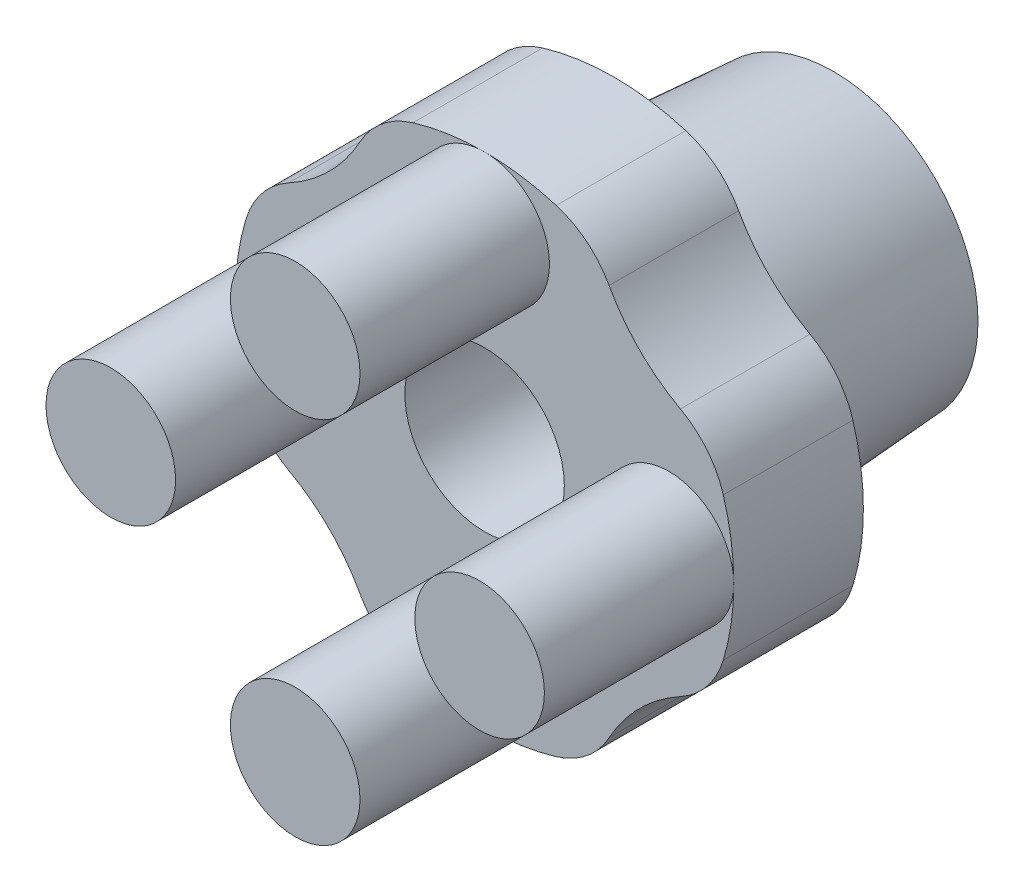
ISO-10303-21;
HEADER;
FILE_DESCRIPTION(('STEP AP214'),'2;1');
FILE_NAME('part.step','',(''),(''),'','','');
FILE_SCHEMA(('AUTOMOTIVE_DESIGN { 1 0 10303 214 1 1 1 1 }'));
ENDSEC;
DATA;
#1=APPLICATION_CONTEXT('core data for automotive mechanical design processes');
#2=APPLICATION_PROTOCOL_DEFINITION('international standard','automotive_design',2000,#1);
#3=PRODUCT_CONTEXT('',#1,'mechanical');
#4=PRODUCT('Part','Part','',(#3));
#5=PRODUCT_RELATED_PRODUCT_CATEGORY('part','',(#4));
#6=PRODUCT_DEFINITION_FORMATION('','',#4);
#7=PRODUCT_DEFINITION_CONTEXT('part definition',#1,'design');
#8=PRODUCT_DEFINITION('design','',#6,#7);
#9=PRODUCT_DEFINITION_SHAPE('','',#8);
#10=(LENGTH_UNIT() NAMED_UNIT(*) SI_UNIT(.MILLI.,.METRE.));
#11=(NAMED_UNIT(*) PLANE_ANGLE_UNIT() SI_UNIT($,.RADIAN.));
#12=(NAMED_UNIT(*) SI_UNIT($,.STERADIAN.) SOLID_ANGLE_UNIT());
#13=UNCERTAINTY_MEASURE_WITH_UNIT(LENGTH_MEASURE(1.E-05),#10,'distance_accuracy_value','');
#14=(GEOMETRIC_REPRESENTATION_CONTEXT(3) GLOBAL_UNCERTAINTY_ASSIGNED_CONTEXT((#13)) GLOBAL_UNIT_ASSIGNED_CONTEXT((#10,
#11,#12)) REPRESENTATION_CONTEXT('',''));
#15=CARTESIAN_POINT('',(0.,0.,0.));
#16=DIRECTION('',(0.,0.,1.));
#17=DIRECTION('',(1.,0.,0.));
#18=AXIS2_PLACEMENT_3D('',#15,#16,#17);
#19=CARTESIAN_POINT('',(-25.,0.,35.));
#20=DIRECTION('',(0.,0.,-1.));
#21=DIRECTION('',(-1.,0.,0.));
#22=AXIS2_PLACEMENT_3D('',#19,#20,#21);
#23=PLANE('',#22);
#24=CARTESIAN_POINT('',(0.,0.,35.));
#25=DIRECTION('',(0.,0.,1.));
#26=DIRECTION('',(1.,0.,0.));
#27=AXIS2_PLACEMENT_3D('',#24,#25,#26);
#28=CIRCLE('',#27,8.);
#29=CARTESIAN_POINT('',(8.,0.,35.));
#30=VERTEX_POINT('',#29);
#31=EDGE_CURVE('E269',#30,#30,#28,.T.);
#32=ORIENTED_EDGE('',*,*,#31,.F.);
#33=EDGE_LOOP('',(#32));
#34=FACE_BOUND('',#33,.T.);
#35=CARTESIAN_POINT('',(28.2842712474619,-28.2842712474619,35.));
#36=DIRECTION('',(0.,0.,1.));
#37=DIRECTION('',(1.,0.,0.));
#38=AXIS2_PLACEMENT_3D('',#35,#36,#37);
#39=CIRCLE('',#38,18.);
#40=CARTESIAN_POINT('',(19.644919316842,-12.4930838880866,35.));
#41=VERTEX_POINT('',#40);
#42=CARTESIAN_POINT('',(12.4930838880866,-19.644919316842,35.));
#43=VERTEX_POINT('',#42);
#44=EDGE_CURVE('E296',#41,#43,#39,.T.);
#45=ORIENTED_EDGE('',*,*,#44,.F.);
#46=CARTESIAN_POINT('',(15.325243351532,-4.59749020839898,35.));
#47=DIRECTION('',(0.,0.,-1.));
#48=DIRECTION('',(-1.,0.,0.));
#49=AXIS2_PLACEMENT_3D('',#46,#47,#48);
#50=CIRCLE('',#49,9.);
#51=CARTESIAN_POINT('',(23.9456927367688,-7.18357845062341,35.));
#52=VERTEX_POINT('',#51);
#53=EDGE_CURVE('E147',#41,#52,#50,.F.);
#54=ORIENTED_EDGE('',*,*,#53,.T.);
#55=CARTESIAN_POINT('',(0.,0.,35.));
#56=DIRECTION('',(0.,0.,1.));
#57=DIRECTION('',(1.,0.,0.));
#58=AXIS2_PLACEMENT_3D('',#55,#56,#57);
#59=CIRCLE('',#58,25.);
#60=CARTESIAN_POINT('',(25.,0.,35.));
#61=VERTEX_POINT('',#60);
#62=EDGE_CURVE('E141',#52,#61,#59,.T.);
#63=ORIENTED_EDGE('',*,*,#62,.T.);
#64=CARTESIAN_POINT('',(18.5,0.,35.));
#65=DIRECTION('',(0.,0.,1.));
#66=DIRECTION('',(1.,0.,0.));
#67=AXIS2_PLACEMENT_3D('',#64,#65,#66);
#68=CIRCLE('',#67,6.5);
#69=EDGE_CURVE('E146',#61,#61,#68,.T.);
#70=ORIENTED_EDGE('',*,*,#69,.F.);
#71=CARTESIAN_POINT('',(23.9456927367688,7.18357845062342,35.));
#72=VERTEX_POINT('',#71);
#73=EDGE_CURVE('E151',#61,#72,#59,.T.);
#74=ORIENTED_EDGE('',*,*,#73,.T.);
#75=CARTESIAN_POINT('',(15.325243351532,4.59749020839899,35.));
#76=DIRECTION('',(0.,0.,-1.));
#77=DIRECTION('',(-1.,0.,0.));
#78=AXIS2_PLACEMENT_3D('',#75,#76,#77);
#79=CIRCLE('',#78,9.);
#80=CARTESIAN_POINT('',(19.644919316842,12.4930838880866,35.));
#81=VERTEX_POINT('',#80);
#82=EDGE_CURVE('E265',#72,#81,#79,.F.);
#83=ORIENTED_EDGE('',*,*,#82,.T.);
#84=CARTESIAN_POINT('',(28.2842712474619,28.2842712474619,35.));
#85=DIRECTION('',(0.,0.,1.));
#86=DIRECTION('',(1.,0.,0.));
#87=AXIS2_PLACEMENT_3D('',#84,#85,#86);
#88=CIRCLE('',#87,18.);
#89=CARTESIAN_POINT('',(12.4930838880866,19.644919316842,35.));
#90=VERTEX_POINT('',#89);
#91=EDGE_CURVE('E225',#90,#81,#88,.T.);
#92=ORIENTED_EDGE('',*,*,#91,.F.);
#93=CARTESIAN_POINT('',(4.59749020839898,15.325243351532,35.));
#94=DIRECTION('',(0.,0.,-1.));
#95=DIRECTION('',(-1.,0.,0.));
#96=AXIS2_PLACEMENT_3D('',#93,#94,#95);
#97=CIRCLE('',#96,9.);
#98=CARTESIAN_POINT('',(7.18357845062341,23.9456927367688,35.));
#99=VERTEX_POINT('',#98);
#100=EDGE_CURVE('E267',#90,#99,#97,.F.);
#101=ORIENTED_EDGE('',*,*,#100,.T.);
#102=CARTESIAN_POINT('',(0.,25.,35.));
#103=VERTEX_POINT('',#102);
#104=EDGE_CURVE('E153',#99,#103,#59,.T.);
#105=ORIENTED_EDGE('',*,*,#104,.T.);
#106=CARTESIAN_POINT('',(0.,18.5,35.));
#107=DIRECTION('',(0.,0.,1.));
#108=DIRECTION('',(1.,0.,0.));
#109=AXIS2_PLACEMENT_3D('',#106,#107,#108);
#110=CIRCLE('',#109,6.5);
#111=EDGE_CURVE('E312',#103,#103,#110,.T.);
#112=ORIENTED_EDGE('',*,*,#111,.F.);
#113=CARTESIAN_POINT('',(-7.18357845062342,23.9456927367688,35.));
#114=VERTEX_POINT('',#113);
#115=EDGE_CURVE('E160',#103,#114,#59,.T.);
#116=ORIENTED_EDGE('',*,*,#115,.T.);
#117=CARTESIAN_POINT('',(-4.59749020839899,15.325243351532,35.));
#118=DIRECTION('',(0.,0.,-1.));
#119=DIRECTION('',(-1.,0.,0.));
#120=AXIS2_PLACEMENT_3D('',#117,#118,#119);
#121=CIRCLE('',#120,9.);
#122=CARTESIAN_POINT('',(-12.4930838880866,19.644919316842,35.));
#123=VERTEX_POINT('',#122);
#124=EDGE_CURVE('E274',#114,#123,#121,.F.);
#125=ORIENTED_EDGE('',*,*,#124,.T.);
#126=CARTESIAN_POINT('',(-28.2842712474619,28.2842712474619,35.));
#127=DIRECTION('',(0.,0.,1.));
#128=DIRECTION('',(1.,0.,0.));
#129=AXIS2_PLACEMENT_3D('',#126,#127,#128);
#130=CIRCLE('',#129,18.);
#131=CARTESIAN_POINT('',(-19.644919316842,12.4930838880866,35.));
#132=VERTEX_POINT('',#131);
#133=EDGE_CURVE('E290',#132,#123,#130,.T.);
#134=ORIENTED_EDGE('',*,*,#133,.F.);
#135=CARTESIAN_POINT('',(-15.325243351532,4.59749020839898,35.));
#136=DIRECTION('',(0.,0.,-1.));
#137=DIRECTION('',(-1.,0.,0.));
#138=AXIS2_PLACEMENT_3D('',#135,#136,#137);
#139=CIRCLE('',#138,9.);
#140=CARTESIAN_POINT('',(-23.9456927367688,7.18357845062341,35.));
#141=VERTEX_POINT('',#140);
#142=EDGE_CURVE('E276',#132,#141,#139,.F.);
#143=ORIENTED_EDGE('',*,*,#142,.T.);
#144=CARTESIAN_POINT('',(-25.,0.,35.));
#145=VERTEX_POINT('',#144);
#146=EDGE_CURVE('E167',#141,#145,#59,.T.);
#147=ORIENTED_EDGE('',*,*,#146,.T.);
#148=CARTESIAN_POINT('',(-18.5,0.,35.));
#149=DIRECTION('',(0.,0.,1.));
#150=DIRECTION('',(1.,0.,0.));
#151=AXIS2_PLACEMENT_3D('',#148,#149,#150);
#152=CIRCLE('',#151,6.5);
#153=EDGE_CURVE('E306',#145,#145,#152,.T.);
#154=ORIENTED_EDGE('',*,*,#153,.F.);
#155=CARTESIAN_POINT('',(-23.9456927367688,-7.18357845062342,35.));
#156=VERTEX_POINT('',#155);
#157=EDGE_CURVE('E168',#145,#156,#59,.T.);
#158=ORIENTED_EDGE('',*,*,#157,.T.);
#159=CARTESIAN_POINT('',(-15.325243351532,-4.59749020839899,35.));
#160=DIRECTION('',(0.,0.,-1.));
#161=DIRECTION('',(-1.,0.,0.));
#162=AXIS2_PLACEMENT_3D('',#159,#160,#161);
#163=CIRCLE('',#162,9.);
#164=CARTESIAN_POINT('',(-19.644919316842,-12.4930838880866,35.));
#165=VERTEX_POINT('',#164);
#166=EDGE_CURVE('E278',#156,#165,#163,.F.);
#167=ORIENTED_EDGE('',*,*,#166,.T.);
#168=CARTESIAN_POINT('',(-28.2842712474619,-28.2842712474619,35.));
#169=DIRECTION('',(0.,0.,1.));
#170=DIRECTION('',(1.,0.,0.));
#171=AXIS2_PLACEMENT_3D('',#168,#169,#170);
#172=CIRCLE('',#171,18.);
#173=CARTESIAN_POINT('',(-12.4930838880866,-19.644919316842,35.));
#174=VERTEX_POINT('',#173);
#175=EDGE_CURVE('E284',#174,#165,#172,.T.);
#176=ORIENTED_EDGE('',*,*,#175,.F.);
#177=CARTESIAN_POINT('',(-4.59749020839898,-15.325243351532,35.));
#178=DIRECTION('',(0.,0.,-1.));
#179=DIRECTION('',(-1.,0.,0.));
#180=AXIS2_PLACEMENT_3D('',#177,#178,#179);
#181=CIRCLE('',#180,9.);
#182=CARTESIAN_POINT('',(-7.18357845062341,-23.9456927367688,35.));
#183=VERTEX_POINT('',#182);
#184=EDGE_CURVE('E280',#174,#183,#181,.F.);
#185=ORIENTED_EDGE('',*,*,#184,.T.);
#186=CARTESIAN_POINT('',(0.,-25.,35.));
#187=VERTEX_POINT('',#186);
#188=EDGE_CURVE('E164',#183,#187,#59,.T.);
#189=ORIENTED_EDGE('',*,*,#188,.T.);
#190=CARTESIAN_POINT('',(0.,-18.5,35.));
#191=DIRECTION('',(0.,0.,1.));
#192=DIRECTION('',(1.,0.,0.));
#193=AXIS2_PLACEMENT_3D('',#190,#191,#192);
#194=CIRCLE('',#193,6.5);
#195=EDGE_CURVE('E181',#187,#187,#194,.T.);
#196=ORIENTED_EDGE('',*,*,#195,.F.);
#197=CARTESIAN_POINT('',(7.18357845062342,-23.9456927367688,35.));
#198=VERTEX_POINT('',#197);
#199=EDGE_CURVE('E150',#187,#198,#59,.T.);
#200=ORIENTED_EDGE('',*,*,#199,.T.);
#201=CARTESIAN_POINT('',(4.59749020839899,-15.325243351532,35.));
#202=DIRECTION('',(0.,0.,-1.));
#203=DIRECTION('',(-1.,0.,0.));
#204=AXIS2_PLACEMENT_3D('',#201,#202,#203);
#205=CIRCLE('',#204,9.);
#206=EDGE_CURVE('E178',#198,#43,#205,.F.);
#207=ORIENTED_EDGE('',*,*,#206,.T.);
#208=EDGE_LOOP('',(#45,#54,#63,#70,#74,#83,#92,#101,#105,#112,#116,#125,#134,#143,#147,#154,
#158,#167,#176,#185,#189,#196,#200,#207));
#209=FACE_BOUND('',#208,.T.);
#210=ADVANCED_FACE('F14',(#34,#209),#23,.F.);
#211=CARTESIAN_POINT('',(0.,0.,90.));
#212=DIRECTION('',(0.,0.,1.));
#213=DIRECTION('',(1.,0.,0.));
#214=AXIS2_PLACEMENT_3D('',#211,#212,#213);
#215=CYLINDRICAL_SURFACE('',#214,25.);
#216=CARTESIAN_POINT('',(0.,0.,22.));
#217=DIRECTION('',(0.,0.,1.));
#218=DIRECTION('',(1.,0.,0.));
#219=AXIS2_PLACEMENT_3D('',#216,#217,#218);
#220=CIRCLE('',#219,25.);
#221=CARTESIAN_POINT('',(-23.9456927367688,7.18357845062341,22.));
#222=VERTEX_POINT('',#221);
#223=CARTESIAN_POINT('',(-23.9456927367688,-7.18357845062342,22.));
#224=VERTEX_POINT('',#223);
#225=EDGE_CURVE('E441',#222,#224,#220,.T.);
#226=ORIENTED_EDGE('',*,*,#225,.T.);
#227=DIRECTION('',(0.,0.,1.));
#228=VECTOR('',#227,1.);
#229=CARTESIAN_POINT('',(-23.9456927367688,-7.18357845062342,90.));
#230=LINE('',#229,#228);
#231=EDGE_CURVE('E205',#224,#156,#230,.T.);
#232=ORIENTED_EDGE('',*,*,#231,.T.);
#233=ORIENTED_EDGE('',*,*,#157,.F.);
#234=ORIENTED_EDGE('',*,*,#146,.F.);
#235=DIRECTION('',(0.,0.,1.));
#236=VECTOR('',#235,1.);
#237=CARTESIAN_POINT('',(-23.9456927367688,7.18357845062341,90.));
#238=LINE('',#237,#236);
#239=EDGE_CURVE('E203',#141,#222,#238,.F.);
#240=ORIENTED_EDGE('',*,*,#239,.T.);
#241=EDGE_LOOP('',(#226,#232,#233,#234,#240));
#242=FACE_BOUND('',#241,.T.);
#243=ADVANCED_FACE('F341',(#242),#215,.T.);
#244=CARTESIAN_POINT('',(7.18357845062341,23.9456927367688,22.));
#245=VERTEX_POINT('',#244);
#246=CARTESIAN_POINT('',(-7.18357845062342,23.9456927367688,22.));
#247=VERTEX_POINT('',#246);
#248=EDGE_CURVE('E440',#245,#247,#220,.T.);
#249=ORIENTED_EDGE('',*,*,#248,.T.);
#250=DIRECTION('',(0.,0.,1.));
#251=VECTOR('',#250,1.);
#252=CARTESIAN_POINT('',(-7.18357845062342,23.9456927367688,90.));
#253=LINE('',#252,#251);
#254=EDGE_CURVE('E215',#247,#114,#253,.T.);
#255=ORIENTED_EDGE('',*,*,#254,.T.);
#256=ORIENTED_EDGE('',*,*,#115,.F.);
#257=ORIENTED_EDGE('',*,*,#104,.F.);
#258=DIRECTION('',(0.,0.,1.));
#259=VECTOR('',#258,1.);
#260=CARTESIAN_POINT('',(7.18357845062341,23.9456927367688,90.));
#261=LINE('',#260,#259);
#262=EDGE_CURVE('E213',#99,#245,#261,.F.);
#263=ORIENTED_EDGE('',*,*,#262,.T.);
#264=EDGE_LOOP('',(#249,#255,#256,#257,#263));
#265=FACE_BOUND('',#264,.T.);
#266=ADVANCED_FACE('F347',(#265),#215,.T.);
#267=ORIENTED_EDGE('',*,*,#62,.F.);
#268=DIRECTION('',(0.,0.,1.));
#269=VECTOR('',#268,1.);
#270=CARTESIAN_POINT('',(23.9456927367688,-7.18357845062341,90.));
#271=LINE('',#270,#269);
#272=CARTESIAN_POINT('',(23.9456927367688,-7.18357845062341,22.));
#273=VERTEX_POINT('',#272);
#274=EDGE_CURVE('E237',#52,#273,#271,.F.);
#275=ORIENTED_EDGE('',*,*,#274,.T.);
#276=CARTESIAN_POINT('',(23.9456927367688,7.18357845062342,22.));
#277=VERTEX_POINT('',#276);
#278=EDGE_CURVE('E171',#273,#277,#220,.T.);
#279=ORIENTED_EDGE('',*,*,#278,.T.);
#280=DIRECTION('',(0.,0.,1.));
#281=VECTOR('',#280,1.);
#282=CARTESIAN_POINT('',(23.9456927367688,7.18357845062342,90.));
#283=LINE('',#282,#281);
#284=EDGE_CURVE('E158',#277,#72,#283,.T.);
#285=ORIENTED_EDGE('',*,*,#284,.T.);
#286=ORIENTED_EDGE('',*,*,#73,.F.);
#287=EDGE_LOOP('',(#267,#275,#279,#285,#286));
#288=FACE_BOUND('',#287,.T.);
#289=ADVANCED_FACE('F155',(#288),#215,.T.);
#290=CARTESIAN_POINT('',(0.,0.,90.));
#291=DIRECTION('',(0.,0.,1.));
#292=DIRECTION('',(1.,0.,0.));
#293=AXIS2_PLACEMENT_3D('',#290,#291,#292);
#294=CYLINDRICAL_SURFACE('',#293,8.);
#295=CARTESIAN_POINT('',(0.,0.,0.));
#296=DIRECTION('',(0.,0.,1.));
#297=DIRECTION('',(1.,0.,0.));
#298=AXIS2_PLACEMENT_3D('',#295,#296,#297);
#299=CIRCLE('',#298,8.);
#300=CARTESIAN_POINT('',(8.,0.,0.));
#301=VERTEX_POINT('',#300);
#302=EDGE_CURVE('E433',#301,#301,#299,.T.);
#303=ORIENTED_EDGE('',*,*,#302,.F.);
#304=EDGE_LOOP('',(#303));
#305=FACE_BOUND('',#304,.T.);
#306=ORIENTED_EDGE('',*,*,#31,.T.);
#307=EDGE_LOOP('',(#306));
#308=FACE_BOUND('',#307,.T.);
#309=ADVANCED_FACE('F352',(#305,#308),#294,.F.);
#310=CARTESIAN_POINT('',(-8.,0.,0.));
#311=DIRECTION('',(0.,0.,1.));
#312=DIRECTION('',(1.,0.,0.));
#313=AXIS2_PLACEMENT_3D('',#310,#311,#312);
#314=PLANE('',#313);
#315=CARTESIAN_POINT('',(0.,0.,0.));
#316=DIRECTION('',(0.,0.,1.));
#317=DIRECTION('',(1.,0.,0.));
#318=AXIS2_PLACEMENT_3D('',#315,#316,#317);
#319=CIRCLE('',#318,14.5);
#320=CARTESIAN_POINT('',(14.5,0.,0.));
#321=VERTEX_POINT('',#320);
#322=EDGE_CURVE('E430',#321,#321,#319,.T.);
#323=ORIENTED_EDGE('',*,*,#322,.F.);
#324=EDGE_LOOP('',(#323));
#325=FACE_BOUND('',#324,.T.);
#326=ORIENTED_EDGE('',*,*,#302,.T.);
#327=EDGE_LOOP('',(#326));
#328=FACE_BOUND('',#327,.T.);
#329=ADVANCED_FACE('F419',(#325,#328),#314,.F.);
#330=CARTESIAN_POINT('',(0.,0.,22.));
#331=DIRECTION('',(0.,0.,1.));
#332=DIRECTION('',(1.,0.,0.));
#333=AXIS2_PLACEMENT_3D('',#330,#331,#332);
#334=CONICAL_SURFACE('',#333,16.,0.0680764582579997);
#335=ORIENTED_EDGE('',*,*,#322,.T.);
#336=EDGE_LOOP('',(#335));
#337=FACE_BOUND('',#336,.T.);
#338=CARTESIAN_POINT('',(0.,0.,22.));
#339=DIRECTION('',(0.,0.,1.));
#340=DIRECTION('',(1.,0.,0.));
#341=AXIS2_PLACEMENT_3D('',#338,#339,#340);
#342=CIRCLE('',#341,16.);
#343=CARTESIAN_POINT('',(16.,0.,22.));
#344=VERTEX_POINT('',#343);
#345=EDGE_CURVE('E436',#344,#344,#342,.T.);
#346=ORIENTED_EDGE('',*,*,#345,.F.);
#347=EDGE_LOOP('',(#346));
#348=FACE_BOUND('',#347,.T.);
#349=ADVANCED_FACE('F417',(#337,#348),#334,.T.);
#350=CARTESIAN_POINT('',(-16.,0.,22.));
#351=DIRECTION('',(0.,0.,1.));
#352=DIRECTION('',(1.,0.,0.));
#353=AXIS2_PLACEMENT_3D('',#350,#351,#352);
#354=PLANE('',#353);
#355=ORIENTED_EDGE('',*,*,#278,.F.);
#356=CARTESIAN_POINT('',(15.325243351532,-4.59749020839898,22.));
#357=DIRECTION('',(0.,0.,1.));
#358=DIRECTION('',(1.,0.,0.));
#359=AXIS2_PLACEMENT_3D('',#356,#357,#358);
#360=CIRCLE('',#359,9.);
#361=CARTESIAN_POINT('',(19.644919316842,-12.4930838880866,22.));
#362=VERTEX_POINT('',#361);
#363=EDGE_CURVE('E197',#273,#362,#360,.F.);
#364=ORIENTED_EDGE('',*,*,#363,.T.);
#365=CARTESIAN_POINT('',(28.2842712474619,-28.2842712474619,22.));
#366=DIRECTION('',(0.,0.,1.));
#367=DIRECTION('',(1.,0.,0.));
#368=AXIS2_PLACEMENT_3D('',#365,#366,#367);
#369=CIRCLE('',#368,18.);
#370=CARTESIAN_POINT('',(12.4930838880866,-19.644919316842,22.));
#371=VERTEX_POINT('',#370);
#372=EDGE_CURVE('E235',#362,#371,#369,.T.);
#373=ORIENTED_EDGE('',*,*,#372,.T.);
#374=CARTESIAN_POINT('',(4.59749020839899,-15.325243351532,22.));
#375=DIRECTION('',(0.,0.,1.));
#376=DIRECTION('',(1.,0.,0.));
#377=AXIS2_PLACEMENT_3D('',#374,#375,#376);
#378=CIRCLE('',#377,9.);
#379=CARTESIAN_POINT('',(7.18357845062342,-23.9456927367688,22.));
#380=VERTEX_POINT('',#379);
#381=EDGE_CURVE('E250',#371,#380,#378,.F.);
#382=ORIENTED_EDGE('',*,*,#381,.T.);
#383=CARTESIAN_POINT('',(-7.18357845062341,-23.9456927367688,22.));
#384=VERTEX_POINT('',#383);
#385=EDGE_CURVE('E190',#384,#380,#220,.T.);
#386=ORIENTED_EDGE('',*,*,#385,.F.);
#387=CARTESIAN_POINT('',(-4.59749020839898,-15.325243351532,22.));
#388=DIRECTION('',(0.,0.,1.));
#389=DIRECTION('',(1.,0.,0.));
#390=AXIS2_PLACEMENT_3D('',#387,#388,#389);
#391=CIRCLE('',#390,9.);
#392=CARTESIAN_POINT('',(-12.4930838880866,-19.644919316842,22.));
#393=VERTEX_POINT('',#392);
#394=EDGE_CURVE('E36',#384,#393,#391,.F.);
#395=ORIENTED_EDGE('',*,*,#394,.T.);
#396=CARTESIAN_POINT('',(-28.2842712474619,-28.2842712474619,22.));
#397=DIRECTION('',(0.,0.,1.));
#398=DIRECTION('',(1.,0.,0.));
#399=AXIS2_PLACEMENT_3D('',#396,#397,#398);
#400=CIRCLE('',#399,18.);
#401=CARTESIAN_POINT('',(-19.644919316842,-12.4930838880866,22.));
#402=VERTEX_POINT('',#401);
#403=EDGE_CURVE('E262',#393,#402,#400,.T.);
#404=ORIENTED_EDGE('',*,*,#403,.T.);
#405=CARTESIAN_POINT('',(-15.325243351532,-4.59749020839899,22.));
#406=DIRECTION('',(0.,0.,1.));
#407=DIRECTION('',(1.,0.,0.));
#408=AXIS2_PLACEMENT_3D('',#405,#406,#407);
#409=CIRCLE('',#408,9.);
#410=EDGE_CURVE('E247',#402,#224,#409,.F.);
#411=ORIENTED_EDGE('',*,*,#410,.T.);
#412=ORIENTED_EDGE('',*,*,#225,.F.);
#413=CARTESIAN_POINT('',(-15.325243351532,4.59749020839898,22.));
#414=DIRECTION('',(0.,0.,1.));
#415=DIRECTION('',(1.,0.,0.));
#416=AXIS2_PLACEMENT_3D('',#413,#414,#415);
#417=CIRCLE('',#416,9.);
#418=CARTESIAN_POINT('',(-19.644919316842,12.4930838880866,22.));
#419=VERTEX_POINT('',#418);
#420=EDGE_CURVE('E245',#222,#419,#417,.F.);
#421=ORIENTED_EDGE('',*,*,#420,.T.);
#422=CARTESIAN_POINT('',(-28.2842712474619,28.2842712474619,22.));
#423=DIRECTION('',(0.,0.,1.));
#424=DIRECTION('',(1.,0.,0.));
#425=AXIS2_PLACEMENT_3D('',#422,#423,#424);
#426=CIRCLE('',#425,18.);
#427=CARTESIAN_POINT('',(-12.4930838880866,19.644919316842,22.));
#428=VERTEX_POINT('',#427);
#429=EDGE_CURVE('E159',#419,#428,#426,.T.);
#430=ORIENTED_EDGE('',*,*,#429,.T.);
#431=CARTESIAN_POINT('',(-4.59749020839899,15.325243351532,22.));
#432=DIRECTION('',(0.,0.,1.));
#433=DIRECTION('',(1.,0.,0.));
#434=AXIS2_PLACEMENT_3D('',#431,#432,#433);
#435=CIRCLE('',#434,9.);
#436=EDGE_CURVE('E239',#428,#247,#435,.F.);
#437=ORIENTED_EDGE('',*,*,#436,.T.);
#438=ORIENTED_EDGE('',*,*,#248,.F.);
#439=CARTESIAN_POINT('',(4.59749020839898,15.325243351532,22.));
#440=DIRECTION('',(0.,0.,1.));
#441=DIRECTION('',(1.,0.,0.));
#442=AXIS2_PLACEMENT_3D('',#439,#440,#441);
#443=CIRCLE('',#442,9.);
#444=CARTESIAN_POINT('',(12.4930838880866,19.644919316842,22.));
#445=VERTEX_POINT('',#444);
#446=EDGE_CURVE('E234',#245,#445,#443,.F.);
#447=ORIENTED_EDGE('',*,*,#446,.T.);
#448=CARTESIAN_POINT('',(28.2842712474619,28.2842712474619,22.));
#449=DIRECTION('',(0.,0.,1.));
#450=DIRECTION('',(1.,0.,0.));
#451=AXIS2_PLACEMENT_3D('',#448,#449,#450);
#452=CIRCLE('',#451,18.);
#453=CARTESIAN_POINT('',(19.644919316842,12.4930838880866,22.));
#454=VERTEX_POINT('',#453);
#455=EDGE_CURVE('E162',#445,#454,#452,.T.);
#456=ORIENTED_EDGE('',*,*,#455,.T.);
#457=CARTESIAN_POINT('',(15.325243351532,4.59749020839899,22.));
#458=DIRECTION('',(0.,0.,1.));
#459=DIRECTION('',(1.,0.,0.));
#460=AXIS2_PLACEMENT_3D('',#457,#458,#459);
#461=CIRCLE('',#460,9.);
#462=EDGE_CURVE('E231',#454,#277,#461,.F.);
#463=ORIENTED_EDGE('',*,*,#462,.T.);
#464=EDGE_LOOP('',(#355,#364,#373,#382,#386,#395,#404,#411,#412,#421,#430,#437,#438,#447,#456,#463));
#465=FACE_BOUND('',#464,.T.);
#466=ORIENTED_EDGE('',*,*,#345,.T.);
#467=EDGE_LOOP('',(#466));
#468=FACE_BOUND('',#467,.T.);
#469=ADVANCED_FACE('F229',(#465,#468),#354,.F.);
#470=ORIENTED_EDGE('',*,*,#385,.T.);
#471=DIRECTION('',(0.,0.,1.));
#472=VECTOR('',#471,1.);
#473=CARTESIAN_POINT('',(7.18357845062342,-23.9456927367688,90.));
#474=LINE('',#473,#472);
#475=EDGE_CURVE('E189',#380,#198,#474,.T.);
#476=ORIENTED_EDGE('',*,*,#475,.T.);
#477=ORIENTED_EDGE('',*,*,#199,.F.);
#478=ORIENTED_EDGE('',*,*,#188,.F.);
#479=DIRECTION('',(0.,0.,1.));
#480=VECTOR('',#479,1.);
#481=CARTESIAN_POINT('',(-7.18357845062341,-23.9456927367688,90.));
#482=LINE('',#481,#480);
#483=EDGE_CURVE('E193',#183,#384,#482,.F.);
#484=ORIENTED_EDGE('',*,*,#483,.T.);
#485=EDGE_LOOP('',(#470,#476,#477,#478,#484));
#486=FACE_BOUND('',#485,.T.);
#487=ADVANCED_FACE('F186',(#486),#215,.T.);
#488=CARTESIAN_POINT('',(-28.2842712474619,-28.2842712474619,20.));
#489=DIRECTION('',(0.,0.,1.));
#490=DIRECTION('',(1.,0.,0.));
#491=AXIS2_PLACEMENT_3D('',#488,#489,#490);
#492=CYLINDRICAL_SURFACE('',#491,18.);
#493=ORIENTED_EDGE('',*,*,#403,.F.);
#494=DIRECTION('',(0.,0.,1.));
#495=VECTOR('',#494,1.);
#496=CARTESIAN_POINT('',(-12.4930838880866,-19.644919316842,20.));
#497=LINE('',#496,#495);
#498=EDGE_CURVE('E195',#393,#174,#497,.T.);
#499=ORIENTED_EDGE('',*,*,#498,.T.);
#500=ORIENTED_EDGE('',*,*,#175,.T.);
#501=DIRECTION('',(0.,0.,1.));
#502=VECTOR('',#501,1.);
#503=CARTESIAN_POINT('',(-19.644919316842,-12.4930838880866,20.));
#504=LINE('',#503,#502);
#505=EDGE_CURVE('E29',#165,#402,#504,.F.);
#506=ORIENTED_EDGE('',*,*,#505,.T.);
#507=EDGE_LOOP('',(#493,#499,#500,#506));
#508=FACE_BOUND('',#507,.T.);
#509=ADVANCED_FACE('F288',(#508),#492,.F.);
#510=CARTESIAN_POINT('',(28.2842712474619,-28.2842712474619,20.));
#511=DIRECTION('',(0.,0.,1.));
#512=DIRECTION('',(1.,0.,0.));
#513=AXIS2_PLACEMENT_3D('',#510,#511,#512);
#514=CYLINDRICAL_SURFACE('',#513,18.);
#515=ORIENTED_EDGE('',*,*,#372,.F.);
#516=DIRECTION('',(0.,0.,1.));
#517=VECTOR('',#516,1.);
#518=CARTESIAN_POINT('',(19.644919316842,-12.4930838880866,20.));
#519=LINE('',#518,#517);
#520=EDGE_CURVE('E259',#362,#41,#519,.T.);
#521=ORIENTED_EDGE('',*,*,#520,.T.);
#522=ORIENTED_EDGE('',*,*,#44,.T.);
#523=DIRECTION('',(0.,0.,1.));
#524=VECTOR('',#523,1.);
#525=CARTESIAN_POINT('',(12.4930838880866,-19.644919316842,20.));
#526=LINE('',#525,#524);
#527=EDGE_CURVE('E261',#43,#371,#526,.F.);
#528=ORIENTED_EDGE('',*,*,#527,.T.);
#529=EDGE_LOOP('',(#515,#521,#522,#528));
#530=FACE_BOUND('',#529,.T.);
#531=ADVANCED_FACE('F258',(#530),#514,.F.);
#532=CARTESIAN_POINT('',(28.2842712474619,28.2842712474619,20.));
#533=DIRECTION('',(0.,0.,1.));
#534=DIRECTION('',(1.,0.,0.));
#535=AXIS2_PLACEMENT_3D('',#532,#533,#534);
#536=CYLINDRICAL_SURFACE('',#535,18.);
#537=ORIENTED_EDGE('',*,*,#455,.F.);
#538=DIRECTION('',(0.,0.,1.));
#539=VECTOR('',#538,1.);
#540=CARTESIAN_POINT('',(12.4930838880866,19.644919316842,20.));
#541=LINE('',#540,#539);
#542=EDGE_CURVE('E9',#445,#90,#541,.T.);
#543=ORIENTED_EDGE('',*,*,#542,.T.);
#544=ORIENTED_EDGE('',*,*,#91,.T.);
#545=DIRECTION('',(0.,0.,1.));
#546=VECTOR('',#545,1.);
#547=CARTESIAN_POINT('',(19.644919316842,12.4930838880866,20.));
#548=LINE('',#547,#546);
#549=EDGE_CURVE('E22',#81,#454,#548,.F.);
#550=ORIENTED_EDGE('',*,*,#549,.T.);
#551=EDGE_LOOP('',(#537,#543,#544,#550));
#552=FACE_BOUND('',#551,.T.);
#553=ADVANCED_FACE('F222',(#552),#536,.F.);
#554=CARTESIAN_POINT('',(-28.2842712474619,28.2842712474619,20.));
#555=DIRECTION('',(0.,0.,1.));
#556=DIRECTION('',(1.,0.,0.));
#557=AXIS2_PLACEMENT_3D('',#554,#555,#556);
#558=CYLINDRICAL_SURFACE('',#557,18.);
#559=ORIENTED_EDGE('',*,*,#429,.F.);
#560=DIRECTION('',(0.,0.,1.));
#561=VECTOR('',#560,1.);
#562=CARTESIAN_POINT('',(-19.644919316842,12.4930838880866,20.));
#563=LINE('',#562,#561);
#564=EDGE_CURVE('E210',#419,#132,#563,.T.);
#565=ORIENTED_EDGE('',*,*,#564,.T.);
#566=ORIENTED_EDGE('',*,*,#133,.T.);
#567=DIRECTION('',(0.,0.,1.));
#568=VECTOR('',#567,1.);
#569=CARTESIAN_POINT('',(-12.4930838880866,19.644919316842,20.));
#570=LINE('',#569,#568);
#571=EDGE_CURVE('E208',#123,#428,#570,.F.);
#572=ORIENTED_EDGE('',*,*,#571,.T.);
#573=EDGE_LOOP('',(#559,#565,#566,#572));
#574=FACE_BOUND('',#573,.T.);
#575=ADVANCED_FACE('F401',(#574),#558,.F.);
#576=CARTESIAN_POINT('',(0.,-18.5,54.));
#577=DIRECTION('',(0.,0.,-1.));
#578=DIRECTION('',(-1.,0.,0.));
#579=AXIS2_PLACEMENT_3D('',#576,#577,#578);
#580=CYLINDRICAL_SURFACE('',#579,6.5);
#581=CARTESIAN_POINT('',(0.,-18.5,54.));
#582=DIRECTION('',(0.,0.,1.));
#583=DIRECTION('',(1.,0.,0.));
#584=AXIS2_PLACEMENT_3D('',#581,#582,#583);
#585=CIRCLE('',#584,6.5);
#586=CARTESIAN_POINT('',(6.5,-18.5,54.));
#587=VERTEX_POINT('',#586);
#588=EDGE_CURVE('E299',#587,#587,#585,.T.);
#589=ORIENTED_EDGE('',*,*,#588,.F.);
#590=EDGE_LOOP('',(#589));
#591=FACE_BOUND('',#590,.T.);
#592=ORIENTED_EDGE('',*,*,#195,.T.);
#593=EDGE_LOOP('',(#592));
#594=FACE_BOUND('',#593,.T.);
#595=ADVANCED_FACE('F391',(#591,#594),#580,.T.);
#596=CARTESIAN_POINT('',(0.,-18.5,54.));
#597=DIRECTION('',(0.,0.,1.));
#598=DIRECTION('',(1.,0.,0.));
#599=AXIS2_PLACEMENT_3D('',#596,#597,#598);
#600=PLANE('',#599);
#601=ORIENTED_EDGE('',*,*,#588,.T.);
#602=EDGE_LOOP('',(#601));
#603=FACE_BOUND('',#602,.T.);
#604=ADVANCED_FACE('F396',(#603),#600,.T.);
#605=CARTESIAN_POINT('',(-18.5,0.,54.));
#606=DIRECTION('',(0.,0.,-1.));
#607=DIRECTION('',(-1.,0.,0.));
#608=AXIS2_PLACEMENT_3D('',#605,#606,#607);
#609=CYLINDRICAL_SURFACE('',#608,6.5);
#610=CARTESIAN_POINT('',(-18.5,0.,54.));
#611=DIRECTION('',(0.,0.,1.));
#612=DIRECTION('',(1.,0.,0.));
#613=AXIS2_PLACEMENT_3D('',#610,#611,#612);
#614=CIRCLE('',#613,6.5);
#615=CARTESIAN_POINT('',(-12.,0.,54.));
#616=VERTEX_POINT('',#615);
#617=EDGE_CURVE('E303',#616,#616,#614,.T.);
#618=ORIENTED_EDGE('',*,*,#617,.F.);
#619=EDGE_LOOP('',(#618));
#620=FACE_BOUND('',#619,.T.);
#621=ORIENTED_EDGE('',*,*,#153,.T.);
#622=EDGE_LOOP('',(#621));
#623=FACE_BOUND('',#622,.T.);
#624=ADVANCED_FACE('F335',(#620,#623),#609,.T.);
#625=CARTESIAN_POINT('',(-18.5,0.,54.));
#626=DIRECTION('',(0.,0.,1.));
#627=DIRECTION('',(1.,0.,0.));
#628=AXIS2_PLACEMENT_3D('',#625,#626,#627);
#629=PLANE('',#628);
#630=ORIENTED_EDGE('',*,*,#617,.T.);
#631=EDGE_LOOP('',(#630));
#632=FACE_BOUND('',#631,.T.);
#633=ADVANCED_FACE('F383',(#632),#629,.T.);
#634=CARTESIAN_POINT('',(0.,18.5,54.));
#635=DIRECTION('',(0.,0.,-1.));
#636=DIRECTION('',(-1.,0.,0.));
#637=AXIS2_PLACEMENT_3D('',#634,#635,#636);
#638=CYLINDRICAL_SURFACE('',#637,6.5);
#639=CARTESIAN_POINT('',(0.,18.5,54.));
#640=DIRECTION('',(0.,0.,1.));
#641=DIRECTION('',(1.,0.,0.));
#642=AXIS2_PLACEMENT_3D('',#639,#640,#641);
#643=CIRCLE('',#642,6.5);
#644=CARTESIAN_POINT('',(6.5,18.5,54.));
#645=VERTEX_POINT('',#644);
#646=EDGE_CURVE('E309',#645,#645,#643,.T.);
#647=ORIENTED_EDGE('',*,*,#646,.F.);
#648=EDGE_LOOP('',(#647));
#649=FACE_BOUND('',#648,.T.);
#650=ORIENTED_EDGE('',*,*,#111,.T.);
#651=EDGE_LOOP('',(#650));
#652=FACE_BOUND('',#651,.T.);
#653=ADVANCED_FACE('F332',(#649,#652),#638,.T.);
#654=CARTESIAN_POINT('',(0.,18.5,54.));
#655=DIRECTION('',(0.,0.,1.));
#656=DIRECTION('',(1.,0.,0.));
#657=AXIS2_PLACEMENT_3D('',#654,#655,#656);
#658=PLANE('',#657);
#659=ORIENTED_EDGE('',*,*,#646,.T.);
#660=EDGE_LOOP('',(#659));
#661=FACE_BOUND('',#660,.T.);
#662=ADVANCED_FACE('F322',(#661),#658,.T.);
#663=CARTESIAN_POINT('',(18.5,0.,54.));
#664=DIRECTION('',(0.,0.,-1.));
#665=DIRECTION('',(-1.,0.,0.));
#666=AXIS2_PLACEMENT_3D('',#663,#664,#665);
#667=CYLINDRICAL_SURFACE('',#666,6.5);
#668=CARTESIAN_POINT('',(18.5,0.,54.));
#669=DIRECTION('',(0.,0.,1.));
#670=DIRECTION('',(1.,0.,0.));
#671=AXIS2_PLACEMENT_3D('',#668,#669,#670);
#672=CIRCLE('',#671,6.5);
#673=CARTESIAN_POINT('',(25.,0.,54.));
#674=VERTEX_POINT('',#673);
#675=EDGE_CURVE('E315',#674,#674,#672,.T.);
#676=ORIENTED_EDGE('',*,*,#675,.F.);
#677=EDGE_LOOP('',(#676));
#678=FACE_BOUND('',#677,.T.);
#679=ORIENTED_EDGE('',*,*,#69,.T.);
#680=EDGE_LOOP('',(#679));
#681=FACE_BOUND('',#680,.T.);
#682=ADVANCED_FACE('F319',(#678,#681),#667,.T.);
#683=CARTESIAN_POINT('',(18.5,0.,54.));
#684=DIRECTION('',(0.,0.,1.));
#685=DIRECTION('',(1.,0.,0.));
#686=AXIS2_PLACEMENT_3D('',#683,#684,#685);
#687=PLANE('',#686);
#688=ORIENTED_EDGE('',*,*,#675,.T.);
#689=EDGE_LOOP('',(#688));
#690=FACE_BOUND('',#689,.T.);
#691=ADVANCED_FACE('F321',(#690),#687,.T.);
#692=CARTESIAN_POINT('',(15.325243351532,-4.59749020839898,90.));
#693=DIRECTION('',(0.,0.,-1.));
#694=DIRECTION('',(-1.,0.,0.));
#695=AXIS2_PLACEMENT_3D('',#692,#693,#694);
#696=CYLINDRICAL_SURFACE('',#695,9.);
#697=ORIENTED_EDGE('',*,*,#363,.F.);
#698=ORIENTED_EDGE('',*,*,#274,.F.);
#699=ORIENTED_EDGE('',*,*,#53,.F.);
#700=ORIENTED_EDGE('',*,*,#520,.F.);
#701=EDGE_LOOP('',(#697,#698,#699,#700));
#702=FACE_BOUND('',#701,.T.);
#703=ADVANCED_FACE('F264',(#702),#696,.T.);
#704=CARTESIAN_POINT('',(4.59749020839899,-15.325243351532,20.));
#705=DIRECTION('',(0.,0.,-1.));
#706=DIRECTION('',(-1.,0.,0.));
#707=AXIS2_PLACEMENT_3D('',#704,#705,#706);
#708=CYLINDRICAL_SURFACE('',#707,9.);
#709=ORIENTED_EDGE('',*,*,#381,.F.);
#710=ORIENTED_EDGE('',*,*,#527,.F.);
#711=ORIENTED_EDGE('',*,*,#206,.F.);
#712=ORIENTED_EDGE('',*,*,#475,.F.);
#713=EDGE_LOOP('',(#709,#710,#711,#712));
#714=FACE_BOUND('',#713,.T.);
#715=ADVANCED_FACE('F338',(#714),#708,.T.);
#716=CARTESIAN_POINT('',(-4.59749020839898,-15.325243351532,90.));
#717=DIRECTION('',(0.,0.,-1.));
#718=DIRECTION('',(-1.,0.,0.));
#719=AXIS2_PLACEMENT_3D('',#716,#717,#718);
#720=CYLINDRICAL_SURFACE('',#719,9.);
#721=ORIENTED_EDGE('',*,*,#394,.F.);
#722=ORIENTED_EDGE('',*,*,#483,.F.);
#723=ORIENTED_EDGE('',*,*,#184,.F.);
#724=ORIENTED_EDGE('',*,*,#498,.F.);
#725=EDGE_LOOP('',(#721,#722,#723,#724));
#726=FACE_BOUND('',#725,.T.);
#727=ADVANCED_FACE('F287',(#726),#720,.T.);
#728=CARTESIAN_POINT('',(-15.325243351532,-4.59749020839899,20.));
#729=DIRECTION('',(0.,0.,-1.));
#730=DIRECTION('',(-1.,0.,0.));
#731=AXIS2_PLACEMENT_3D('',#728,#729,#730);
#732=CYLINDRICAL_SURFACE('',#731,9.);
#733=ORIENTED_EDGE('',*,*,#410,.F.);
#734=ORIENTED_EDGE('',*,*,#505,.F.);
#735=ORIENTED_EDGE('',*,*,#166,.F.);
#736=ORIENTED_EDGE('',*,*,#231,.F.);
#737=EDGE_LOOP('',(#733,#734,#735,#736));
#738=FACE_BOUND('',#737,.T.);
#739=ADVANCED_FACE('F359',(#738),#732,.T.);
#740=CARTESIAN_POINT('',(-15.325243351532,4.59749020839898,90.));
#741=DIRECTION('',(0.,0.,-1.));
#742=DIRECTION('',(-1.,0.,0.));
#743=AXIS2_PLACEMENT_3D('',#740,#741,#742);
#744=CYLINDRICAL_SURFACE('',#743,9.);
#745=ORIENTED_EDGE('',*,*,#420,.F.);
#746=ORIENTED_EDGE('',*,*,#239,.F.);
#747=ORIENTED_EDGE('',*,*,#142,.F.);
#748=ORIENTED_EDGE('',*,*,#564,.F.);
#749=EDGE_LOOP('',(#745,#746,#747,#748));
#750=FACE_BOUND('',#749,.T.);
#751=ADVANCED_FACE('F362',(#750),#744,.T.);
#752=CARTESIAN_POINT('',(-4.59749020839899,15.325243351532,20.));
#753=DIRECTION('',(0.,0.,-1.));
#754=DIRECTION('',(-1.,0.,0.));
#755=AXIS2_PLACEMENT_3D('',#752,#753,#754);
#756=CYLINDRICAL_SURFACE('',#755,9.);
#757=ORIENTED_EDGE('',*,*,#436,.F.);
#758=ORIENTED_EDGE('',*,*,#571,.F.);
#759=ORIENTED_EDGE('',*,*,#124,.F.);
#760=ORIENTED_EDGE('',*,*,#254,.F.);
#761=EDGE_LOOP('',(#757,#758,#759,#760));
#762=FACE_BOUND('',#761,.T.);
#763=ADVANCED_FACE('F366',(#762),#756,.T.);
#764=CARTESIAN_POINT('',(4.59749020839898,15.325243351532,90.));
#765=DIRECTION('',(0.,0.,-1.));
#766=DIRECTION('',(-1.,0.,0.));
#767=AXIS2_PLACEMENT_3D('',#764,#765,#766);
#768=CYLINDRICAL_SURFACE('',#767,9.);
#769=ORIENTED_EDGE('',*,*,#446,.F.);
#770=ORIENTED_EDGE('',*,*,#262,.F.);
#771=ORIENTED_EDGE('',*,*,#100,.F.);
#772=ORIENTED_EDGE('',*,*,#542,.F.);
#773=EDGE_LOOP('',(#769,#770,#771,#772));
#774=FACE_BOUND('',#773,.T.);
#775=ADVANCED_FACE('F369',(#774),#768,.T.);
#776=CARTESIAN_POINT('',(15.325243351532,4.59749020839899,20.));
#777=DIRECTION('',(0.,0.,-1.));
#778=DIRECTION('',(-1.,0.,0.));
#779=AXIS2_PLACEMENT_3D('',#776,#777,#778);
#780=CYLINDRICAL_SURFACE('',#779,9.);
#781=ORIENTED_EDGE('',*,*,#462,.F.);
#782=ORIENTED_EDGE('',*,*,#549,.F.);
#783=ORIENTED_EDGE('',*,*,#82,.F.);
#784=ORIENTED_EDGE('',*,*,#284,.F.);
#785=EDGE_LOOP('',(#781,#782,#783,#784));
#786=FACE_BOUND('',#785,.T.);
#787=ADVANCED_FACE('F16',(#786),#780,.T.);
#788=CLOSED_SHELL('',(#210,#243,#266,#289,#309,#329,#349,#469,#487,#509,#531,#553,#575,#595,
#604,#624,#633,#653,#662,#682,#691,#703,#715,#727,#739,#751,#763,#775,#787));
#789=MANIFOLD_SOLID_BREP('B1',#788);
#790=ADVANCED_BREP_SHAPE_REPRESENTATION('',(#18,#789),#14);
#791=SHAPE_DEFINITION_REPRESENTATION(#9,#790);
ENDSEC;
END-ISO-10303-21;
